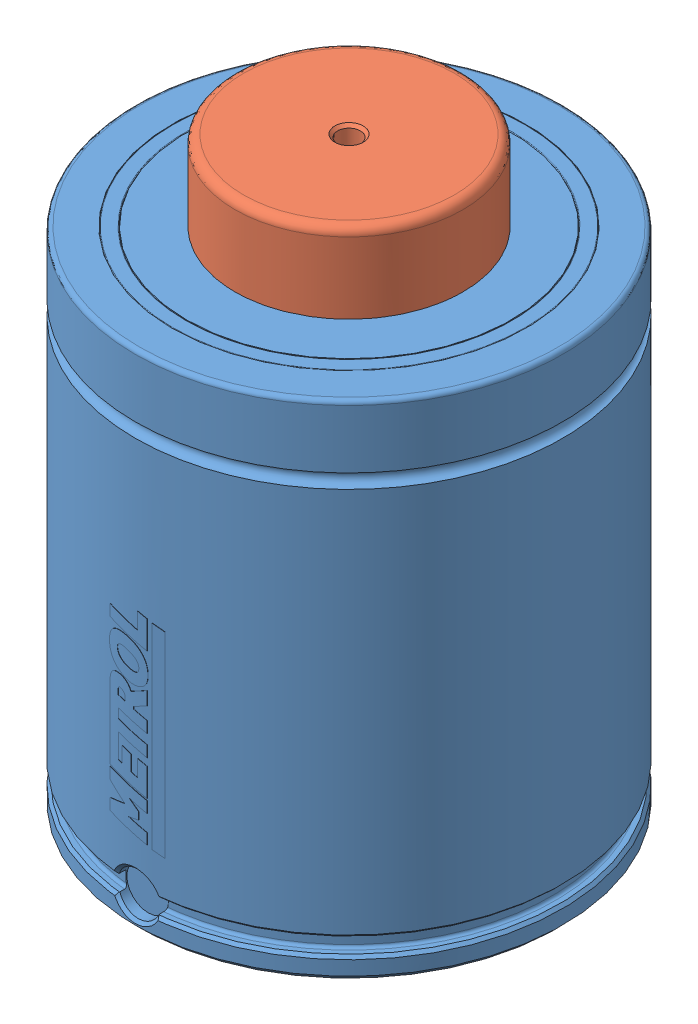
SolidWorks assembly ISNG7500-025.SLDASM, configuration Default (file format 7000). Lengths in mm.
Overall size (158.34 205 158.34).
2 component instances, 2 part files, 5 mates.
Components (placement in the parent):
- ISNG-7500 Body-1: ISNG-7500 Body.SLDPRT [ISNG7500-025] x (0 0 1) z (0 -1 0) size (150.11 150 177)
- ISNG-7500 Piston-1: ISNG-7500 Piston.SLDPRT [ISNG-7500-25] at (0 152 0) x (0.914203 0 -0.405257) z (0 -1 0) size (120 120 53)
Mates (geometry in assembly coordinates):
- Concentric1: concentric aligned: cylinder of ISNG-7500 Body-1 through (0 0 0) axis (0 -1 0) radius 40; cylinder of ISNG-7500 Piston-1 through (0 152 0) axis (0 -1 0) radius 40
- LimitDistance1: limit distance anti-aligned: plane of ISNG-7500 Body-1 through (-40 157 0) normal (0 -1 0); plane of ISNG-7500 Piston-1 through (24.3154 157 54.8522) normal (0 1 0)
- Coincident1: coincident anti-aligned: plane of ISNG-7500 Body-1 through (0 0 0) normal (0 -1 0); plane of assembly through (0 0 0) normal (0 1 0)
- Coincident4: coincident aligned: plane of ISNG-7500 Body-1; plane of assembly through (0 0 0) normal (0 0 1)
- Coincident5: coincident anti-aligned: plane of ISNG-7500 Body-1; plane of assembly through (0 0 0) normal (1 0 0)
